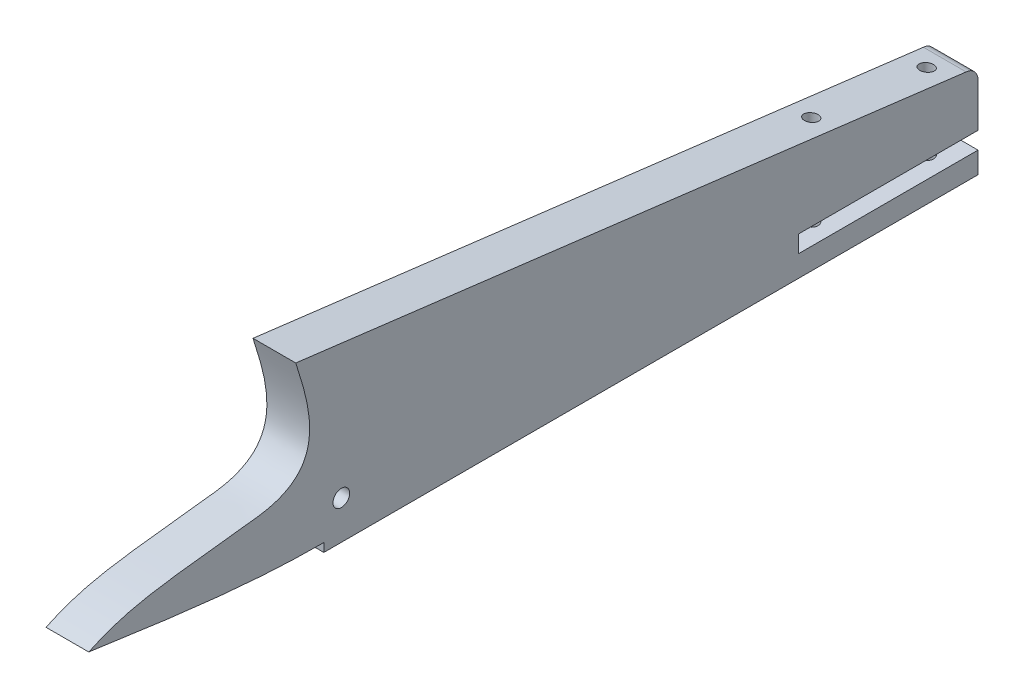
from build123d import *

# Parameters (mm, degrees)
ESQUISSE1_R             = 1.95
EXTRUSION1_DEPTH        = 10
ESQUISSE2_R             = 1.6
ENL_V_MAT_EXTRU_1_DEPTH = 28
ENL_V_MAT_EXTRU_2_DEPTH = 8


with BuildPart() as part:
    # Esquisse1 → Extrusion1 (new body)
    with BuildSketch(Plane(origin=(0, 0, 0), x_dir=(0, 0, -1), z_dir=(1, 0, 0))):
        with BuildLine():
            Line((297.236393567, 22.218445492), (140.434725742, 41.661330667))
            add(Edge.make_bspline(
                [(92.018026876, 7.329447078), (101.612446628, 11.791896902), (108.31601961, 12.281213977), (147.619938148, 16.822561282), (144.549629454, 29.041633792), (140.434725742, 41.661330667)],
                knots=[0.115839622, 0.115839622, 0.115839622, 0.115839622, 0.614991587, 0.614991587, 0.980332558, 0.980332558, 0.980332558, 0.980332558], degree=3))
            add(Edge.make_bspline(
                [(92.018026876, 7.329447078), (110.515139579, 4.69738073), (128.808948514, 2.009596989), (147, 2)],
                knots=[0.628986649, 0.628986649, 0.628986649, 0.628986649, 1, 1, 1, 1], degree=3))
            Line((147, 2), (147, 0))
            Line((147, 0), (300, 0))
            Line((300, 0), (300, 5))
            Line((300, 5), (258, 5))
            Line((258, 5), (258, 9))
            Line((258, 9), (300, 9))
            Line((300, 9), (300, 19.227773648))
            ThreePointArc((300, 19.227773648), (299.203313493, 21.263801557), (297.236393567, 22.218445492))
        make_face()
        with Locations((151.089942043, 9)):
            Circle(ESQUISSE1_R, mode=Mode.SUBTRACT)
    extrude(amount=EXTRUSION1_DEPTH)

    # Esquisse2 → Enl_v. mat.-Extru.1 (cut)
    with BuildSketch(Plane.XZ):
        with Locations(Location((5, -293, 0), (0, 0, 270))):
            Circle(ESQUISSE2_R)
        with Locations(Location((5, -266, 0), (0, 0, 270))):
            Circle(ESQUISSE2_R)
    extrude(amount=-ENL_V_MAT_EXTRU_1_DEPTH, mode=Mode.SUBTRACT)

    # Esquisse3 → Enl_v. mat.-Extru.2 (cut)
    with BuildSketch(Plane.XZ):
        with BuildLine():
            Line((7.5, -249.5), (2.5, -249.5))
            ThreePointArc((2.5, -249.5), (2, -250), (2.5, -250.5))
            Line((2.5, -250.5), (7.5, -250.5))
            ThreePointArc((7.5, -250.5), (8, -250), (7.5, -249.5))
        make_face()
    extrude(amount=-ENL_V_MAT_EXTRU_2_DEPTH, mode=Mode.SUBTRACT)


solid = part.part
